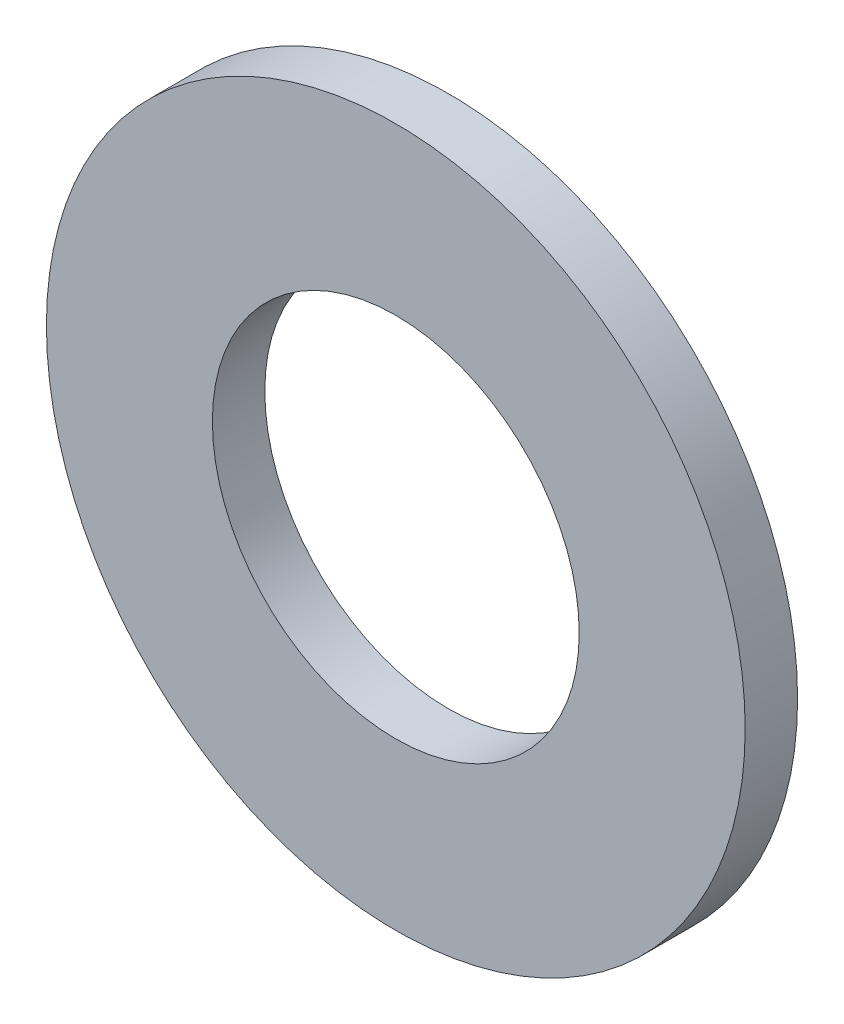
ISO-10303-21;
HEADER;
FILE_DESCRIPTION(('STEP AP214'),'2;1');
FILE_NAME('part.step','',(''),(''),'','','');
FILE_SCHEMA(('AUTOMOTIVE_DESIGN { 1 0 10303 214 1 1 1 1 }'));
ENDSEC;
DATA;
#1=APPLICATION_CONTEXT('core data for automotive mechanical design processes');
#2=APPLICATION_PROTOCOL_DEFINITION('international standard','automotive_design',2000,#1);
#3=PRODUCT_CONTEXT('',#1,'mechanical');
#4=PRODUCT('Part','Part','',(#3));
#5=PRODUCT_RELATED_PRODUCT_CATEGORY('part','',(#4));
#6=PRODUCT_DEFINITION_FORMATION('','',#4);
#7=PRODUCT_DEFINITION_CONTEXT('part definition',#1,'design');
#8=PRODUCT_DEFINITION('design','',#6,#7);
#9=PRODUCT_DEFINITION_SHAPE('','',#8);
#10=(LENGTH_UNIT() NAMED_UNIT(*) SI_UNIT(.MILLI.,.METRE.));
#11=(NAMED_UNIT(*) PLANE_ANGLE_UNIT() SI_UNIT($,.RADIAN.));
#12=(NAMED_UNIT(*) SI_UNIT($,.STERADIAN.) SOLID_ANGLE_UNIT());
#13=UNCERTAINTY_MEASURE_WITH_UNIT(LENGTH_MEASURE(1.E-05),#10,'distance_accuracy_value','');
#14=(GEOMETRIC_REPRESENTATION_CONTEXT(3) GLOBAL_UNCERTAINTY_ASSIGNED_CONTEXT((#13)) GLOBAL_UNIT_ASSIGNED_CONTEXT((#10,
#11,#12)) REPRESENTATION_CONTEXT('',''));
#15=CARTESIAN_POINT('',(0.,0.,0.));
#16=DIRECTION('',(0.,0.,1.));
#17=DIRECTION('',(1.,0.,0.));
#18=AXIS2_PLACEMENT_3D('',#15,#16,#17);
#19=CARTESIAN_POINT('',(0.,0.,3.));
#20=DIRECTION('',(0.,0.,-1.));
#21=DIRECTION('',(-1.00000000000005,0.,0.));
#22=AXIS2_PLACEMENT_3D('',#19,#20,#21);
#23=CYLINDRICAL_SURFACE('',#22,20.);
#24=CARTESIAN_POINT('',(0.,0.,3.));
#25=DIRECTION('',(0.,0.,1.));
#26=DIRECTION('',(1.00000000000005,0.,0.));
#27=AXIS2_PLACEMENT_3D('',#24,#25,#26);
#28=CIRCLE('',#27,20.);
#29=CARTESIAN_POINT('',(20.000000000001,0.,3.));
#30=VERTEX_POINT('',#29);
#31=EDGE_CURVE('E10',#30,#30,#28,.T.);
#32=ORIENTED_EDGE('',*,*,#31,.F.);
#33=EDGE_LOOP('',(#32));
#34=FACE_BOUND('',#33,.T.);
#35=CARTESIAN_POINT('',(0.,0.,0.));
#36=DIRECTION('',(0.,0.,1.));
#37=DIRECTION('',(1.00000000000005,0.,0.));
#38=AXIS2_PLACEMENT_3D('',#35,#36,#37);
#39=CIRCLE('',#38,20.);
#40=CARTESIAN_POINT('',(20.000000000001,0.,0.));
#41=VERTEX_POINT('',#40);
#42=EDGE_CURVE('E34',#41,#41,#39,.T.);
#43=ORIENTED_EDGE('',*,*,#42,.T.);
#44=EDGE_LOOP('',(#43));
#45=FACE_BOUND('',#44,.T.);
#46=ADVANCED_FACE('F28',(#34,#45),#23,.T.);
#47=CARTESIAN_POINT('',(0.,0.,3.));
#48=DIRECTION('',(0.,0.,1.));
#49=DIRECTION('',(1.00000000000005,0.,0.));
#50=AXIS2_PLACEMENT_3D('',#47,#48,#49);
#51=PLANE('',#50);
#52=CARTESIAN_POINT('',(0.,0.,3.));
#53=DIRECTION('',(0.,0.,-1.));
#54=DIRECTION('',(-1.00000000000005,0.,0.));
#55=AXIS2_PLACEMENT_3D('',#52,#53,#54);
#56=CIRCLE('',#55,10.5);
#57=CARTESIAN_POINT('',(-10.5000000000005,0.,3.));
#58=VERTEX_POINT('',#57);
#59=EDGE_CURVE('E38',#58,#58,#56,.T.);
#60=ORIENTED_EDGE('',*,*,#59,.T.);
#61=EDGE_LOOP('',(#60));
#62=FACE_BOUND('',#61,.T.);
#63=ORIENTED_EDGE('',*,*,#31,.T.);
#64=EDGE_LOOP('',(#63));
#65=FACE_BOUND('',#64,.T.);
#66=ADVANCED_FACE('F53',(#62,#65),#51,.T.);
#67=CARTESIAN_POINT('',(0.,0.,0.));
#68=DIRECTION('',(0.,0.,1.));
#69=DIRECTION('',(1.00000000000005,0.,0.));
#70=AXIS2_PLACEMENT_3D('',#67,#68,#69);
#71=PLANE('',#70);
#72=CARTESIAN_POINT('',(0.,0.,0.));
#73=DIRECTION('',(0.,0.,-1.));
#74=DIRECTION('',(-1.00000000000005,0.,0.));
#75=AXIS2_PLACEMENT_3D('',#72,#73,#74);
#76=CIRCLE('',#75,10.5);
#77=CARTESIAN_POINT('',(-10.5000000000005,0.,0.));
#78=VERTEX_POINT('',#77);
#79=EDGE_CURVE('E42',#78,#78,#76,.T.);
#80=ORIENTED_EDGE('',*,*,#79,.F.);
#81=EDGE_LOOP('',(#80));
#82=FACE_BOUND('',#81,.T.);
#83=ORIENTED_EDGE('',*,*,#42,.F.);
#84=EDGE_LOOP('',(#83));
#85=FACE_BOUND('',#84,.T.);
#86=ADVANCED_FACE('F50',(#82,#85),#71,.F.);
#87=CARTESIAN_POINT('',(0.,0.,3.));
#88=DIRECTION('',(0.,0.,-1.));
#89=DIRECTION('',(-1.00000000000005,0.,0.));
#90=AXIS2_PLACEMENT_3D('',#87,#88,#89);
#91=CYLINDRICAL_SURFACE('',#90,10.5);
#92=ORIENTED_EDGE('',*,*,#59,.F.);
#93=EDGE_LOOP('',(#92));
#94=FACE_BOUND('',#93,.T.);
#95=ORIENTED_EDGE('',*,*,#79,.T.);
#96=EDGE_LOOP('',(#95));
#97=FACE_BOUND('',#96,.T.);
#98=ADVANCED_FACE('F48',(#94,#97),#91,.F.);
#99=CLOSED_SHELL('',(#46,#66,#86,#98));
#100=MANIFOLD_SOLID_BREP('B2',#99);
#101=ADVANCED_BREP_SHAPE_REPRESENTATION('',(#18,#100),#14);
#102=SHAPE_DEFINITION_REPRESENTATION(#9,#101);
ENDSEC;
END-ISO-10303-21;
